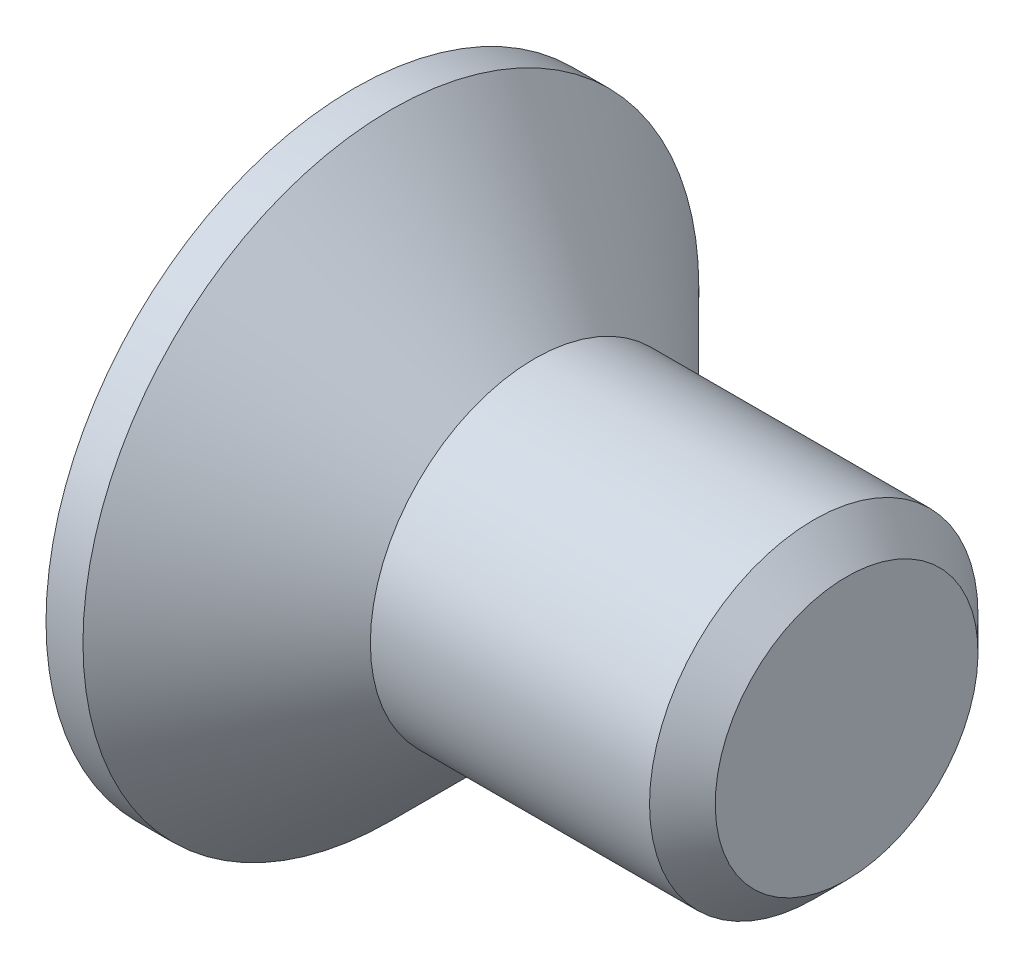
ISO-10303-21;
HEADER;
FILE_DESCRIPTION(('STEP AP214'),'2;1');
FILE_NAME('part.step','',(''),(''),'','','');
FILE_SCHEMA(('AUTOMOTIVE_DESIGN { 1 0 10303 214 1 1 1 1 }'));
ENDSEC;
DATA;
#1=APPLICATION_CONTEXT('core data for automotive mechanical design processes');
#2=APPLICATION_PROTOCOL_DEFINITION('international standard','automotive_design',2000,#1);
#3=PRODUCT_CONTEXT('',#1,'mechanical');
#4=PRODUCT('Part','Part','',(#3));
#5=PRODUCT_RELATED_PRODUCT_CATEGORY('part','',(#4));
#6=PRODUCT_DEFINITION_FORMATION('','',#4);
#7=PRODUCT_DEFINITION_CONTEXT('part definition',#1,'design');
#8=PRODUCT_DEFINITION('design','',#6,#7);
#9=PRODUCT_DEFINITION_SHAPE('','',#8);
#10=(LENGTH_UNIT() NAMED_UNIT(*) SI_UNIT(.MILLI.,.METRE.));
#11=(NAMED_UNIT(*) PLANE_ANGLE_UNIT() SI_UNIT($,.RADIAN.));
#12=(NAMED_UNIT(*) SI_UNIT($,.STERADIAN.) SOLID_ANGLE_UNIT());
#13=UNCERTAINTY_MEASURE_WITH_UNIT(LENGTH_MEASURE(1.E-05),#10,'distance_accuracy_value','');
#14=(GEOMETRIC_REPRESENTATION_CONTEXT(3) GLOBAL_UNCERTAINTY_ASSIGNED_CONTEXT((#13)) GLOBAL_UNIT_ASSIGNED_CONTEXT((#10,
#11,#12)) REPRESENTATION_CONTEXT('',''));
#15=CARTESIAN_POINT('',(0.,0.,0.));
#16=DIRECTION('',(0.,0.,1.));
#17=DIRECTION('',(1.,0.,0.));
#18=AXIS2_PLACEMENT_3D('',#15,#16,#17);
#19=CARTESIAN_POINT('',(0.,0.,0.));
#20=DIRECTION('',(-1.,0.,0.));
#21=DIRECTION('',(0.,-1.,0.));
#22=AXIS2_PLACEMENT_3D('',#19,#20,#21);
#23=CONICAL_SURFACE('',#22,2.,0.78539816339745);
#24=CARTESIAN_POINT('',(-1.74999999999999,0.,0.));
#25=DIRECTION('',(-1.,0.,0.));
#26=DIRECTION('',(0.,-1.,0.));
#27=AXIS2_PLACEMENT_3D('',#24,#25,#26);
#28=CIRCLE('',#27,3.75);
#29=CARTESIAN_POINT('',(-1.74999999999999,-3.75,0.));
#30=VERTEX_POINT('',#29);
#31=EDGE_CURVE('E189',#30,#30,#28,.T.);
#32=ORIENTED_EDGE('',*,*,#31,.F.);
#33=EDGE_LOOP('',(#32));
#34=FACE_BOUND('',#33,.T.);
#35=CARTESIAN_POINT('',(0.,0.,0.));
#36=DIRECTION('',(-1.,0.,0.));
#37=DIRECTION('',(0.,-1.,0.));
#38=AXIS2_PLACEMENT_3D('',#35,#36,#37);
#39=CIRCLE('',#38,2.);
#40=CARTESIAN_POINT('',(0.,-2.,0.));
#41=VERTEX_POINT('',#40);
#42=EDGE_CURVE('E212',#41,#41,#39,.T.);
#43=ORIENTED_EDGE('',*,*,#42,.T.);
#44=EDGE_LOOP('',(#43));
#45=FACE_BOUND('',#44,.T.);
#46=ADVANCED_FACE('F33',(#34,#45),#23,.T.);
#47=CARTESIAN_POINT('',(-2.2,0.,0.));
#48=DIRECTION('',(-1.,0.,0.));
#49=DIRECTION('',(0.,-1.,0.));
#50=AXIS2_PLACEMENT_3D('',#47,#48,#49);
#51=CYLINDRICAL_SURFACE('',#50,2.);
#52=CARTESIAN_POINT('',(3.4,0.,0.));
#53=DIRECTION('',(-1.,0.,0.));
#54=DIRECTION('',(0.,-1.,0.));
#55=AXIS2_PLACEMENT_3D('',#52,#53,#54);
#56=CIRCLE('',#55,2.);
#57=CARTESIAN_POINT('',(3.4,-2.,0.));
#58=VERTEX_POINT('',#57);
#59=EDGE_CURVE('E41',#58,#58,#56,.T.);
#60=ORIENTED_EDGE('',*,*,#59,.T.);
#61=EDGE_LOOP('',(#60));
#62=FACE_BOUND('',#61,.T.);
#63=ORIENTED_EDGE('',*,*,#42,.F.);
#64=EDGE_LOOP('',(#63));
#65=FACE_BOUND('',#64,.T.);
#66=ADVANCED_FACE('F217',(#62,#65),#51,.T.);
#67=CARTESIAN_POINT('',(3.8,0.,0.));
#68=DIRECTION('',(-1.,0.,0.));
#69=DIRECTION('',(0.,-1.,0.));
#70=AXIS2_PLACEMENT_3D('',#67,#68,#69);
#71=PLANE('',#70);
#72=CARTESIAN_POINT('',(3.8,0.,0.));
#73=DIRECTION('',(-1.,0.,0.));
#74=DIRECTION('',(0.,-1.,0.));
#75=AXIS2_PLACEMENT_3D('',#72,#73,#74);
#76=CIRCLE('',#75,1.6);
#77=CARTESIAN_POINT('',(3.8,-1.6,0.));
#78=VERTEX_POINT('',#77);
#79=EDGE_CURVE('E11',#78,#78,#76,.F.);
#80=ORIENTED_EDGE('',*,*,#79,.T.);
#81=EDGE_LOOP('',(#80));
#82=FACE_BOUND('',#81,.T.);
#83=ADVANCED_FACE('F239',(#82),#71,.F.);
#84=CARTESIAN_POINT('',(-2.2,3.75,0.));
#85=DIRECTION('',(1.,0.,0.));
#86=DIRECTION('',(0.,1.,0.));
#87=AXIS2_PLACEMENT_3D('',#84,#85,#86);
#88=PLANE('',#87);
#89=DIRECTION('',(0.,0.,-1.));
#90=VECTOR('',#89,1.);
#91=CARTESIAN_POINT('',(-2.2,0.55,-2.2));
#92=LINE('',#91,#90);
#93=CARTESIAN_POINT('',(-2.2,0.55,-0.55));
#94=VERTEX_POINT('',#93);
#95=CARTESIAN_POINT('',(-2.2,0.55,-2.2));
#96=VERTEX_POINT('',#95);
#97=EDGE_CURVE('E158',#94,#96,#92,.T.);
#98=ORIENTED_EDGE('',*,*,#97,.F.);
#99=DIRECTION('',(0.,-1.,0.));
#100=VECTOR('',#99,1.);
#101=CARTESIAN_POINT('',(-2.2,0.55,-0.55));
#102=LINE('',#101,#100);
#103=CARTESIAN_POINT('',(-2.2,2.2,-0.55));
#104=VERTEX_POINT('',#103);
#105=EDGE_CURVE('E48',#104,#94,#102,.T.);
#106=ORIENTED_EDGE('',*,*,#105,.F.);
#107=DIRECTION('',(0.,0.,-1.));
#108=VECTOR('',#107,1.);
#109=CARTESIAN_POINT('',(-2.2,2.2,-0.55));
#110=LINE('',#109,#108);
#111=CARTESIAN_POINT('',(-2.2,2.2,0.55));
#112=VERTEX_POINT('',#111);
#113=EDGE_CURVE('E185',#112,#104,#110,.T.);
#114=ORIENTED_EDGE('',*,*,#113,.F.);
#115=DIRECTION('',(0.,1.,0.));
#116=VECTOR('',#115,1.);
#117=CARTESIAN_POINT('',(-2.2,2.2,0.55));
#118=LINE('',#117,#116);
#119=CARTESIAN_POINT('',(-2.2,0.55,0.55));
#120=VERTEX_POINT('',#119);
#121=EDGE_CURVE('E183',#120,#112,#118,.T.);
#122=ORIENTED_EDGE('',*,*,#121,.F.);
#123=DIRECTION('',(0.,0.,-1.));
#124=VECTOR('',#123,1.);
#125=CARTESIAN_POINT('',(-2.2,0.55,0.55));
#126=LINE('',#125,#124);
#127=CARTESIAN_POINT('',(-2.2,0.55,2.2));
#128=VERTEX_POINT('',#127);
#129=EDGE_CURVE('E132',#128,#120,#126,.T.);
#130=ORIENTED_EDGE('',*,*,#129,.F.);
#131=DIRECTION('',(0.,1.,0.));
#132=VECTOR('',#131,1.);
#133=CARTESIAN_POINT('',(-2.2,0.55,2.2));
#134=LINE('',#133,#132);
#135=CARTESIAN_POINT('',(-2.2,-0.55,2.2));
#136=VERTEX_POINT('',#135);
#137=EDGE_CURVE('E179',#136,#128,#134,.T.);
#138=ORIENTED_EDGE('',*,*,#137,.F.);
#139=DIRECTION('',(0.,0.,1.));
#140=VECTOR('',#139,1.);
#141=CARTESIAN_POINT('',(-2.2,-0.55,2.2));
#142=LINE('',#141,#140);
#143=CARTESIAN_POINT('',(-2.2,-0.55,0.55));
#144=VERTEX_POINT('',#143);
#145=EDGE_CURVE('E176',#144,#136,#142,.T.);
#146=ORIENTED_EDGE('',*,*,#145,.F.);
#147=DIRECTION('',(0.,1.,0.));
#148=VECTOR('',#147,1.);
#149=CARTESIAN_POINT('',(-2.2,-0.55,0.55));
#150=LINE('',#149,#148);
#151=CARTESIAN_POINT('',(-2.2,-2.2,0.55));
#152=VERTEX_POINT('',#151);
#153=EDGE_CURVE('E173',#152,#144,#150,.T.);
#154=ORIENTED_EDGE('',*,*,#153,.F.);
#155=DIRECTION('',(0.,0.,1.));
#156=VECTOR('',#155,1.);
#157=CARTESIAN_POINT('',(-2.2,-2.2,0.55));
#158=LINE('',#157,#156);
#159=CARTESIAN_POINT('',(-2.2,-2.2,-0.55));
#160=VERTEX_POINT('',#159);
#161=EDGE_CURVE('E170',#160,#152,#158,.T.);
#162=ORIENTED_EDGE('',*,*,#161,.F.);
#163=DIRECTION('',(0.,-1.,0.));
#164=VECTOR('',#163,1.);
#165=CARTESIAN_POINT('',(-2.2,-2.2,-0.55));
#166=LINE('',#165,#164);
#167=CARTESIAN_POINT('',(-2.2,-0.55,-0.55));
#168=VERTEX_POINT('',#167);
#169=EDGE_CURVE('E167',#168,#160,#166,.T.);
#170=ORIENTED_EDGE('',*,*,#169,.F.);
#171=DIRECTION('',(0.,0.,1.));
#172=VECTOR('',#171,1.);
#173=CARTESIAN_POINT('',(-2.2,-0.55,-0.55));
#174=LINE('',#173,#172);
#175=CARTESIAN_POINT('',(-2.2,-0.55,-2.2));
#176=VERTEX_POINT('',#175);
#177=EDGE_CURVE('E164',#176,#168,#174,.T.);
#178=ORIENTED_EDGE('',*,*,#177,.F.);
#179=DIRECTION('',(0.,-1.,0.));
#180=VECTOR('',#179,1.);
#181=CARTESIAN_POINT('',(-2.2,-0.55,-2.2));
#182=LINE('',#181,#180);
#183=EDGE_CURVE('E161',#96,#176,#182,.T.);
#184=ORIENTED_EDGE('',*,*,#183,.F.);
#185=EDGE_LOOP('',(#98,#106,#114,#122,#130,#138,#146,#154,#162,#170,#178,#184));
#186=FACE_BOUND('',#185,.T.);
#187=CARTESIAN_POINT('',(-2.2,0.,0.));
#188=DIRECTION('',(-1.,0.,0.));
#189=DIRECTION('',(0.,-1.,0.));
#190=AXIS2_PLACEMENT_3D('',#187,#188,#189);
#191=CIRCLE('',#190,3.75);
#192=CARTESIAN_POINT('',(-2.2,-3.75,0.));
#193=VERTEX_POINT('',#192);
#194=EDGE_CURVE('E209',#193,#193,#191,.T.);
#195=ORIENTED_EDGE('',*,*,#194,.T.);
#196=EDGE_LOOP('',(#195));
#197=FACE_BOUND('',#196,.T.);
#198=ADVANCED_FACE('F230',(#186,#197),#88,.F.);
#199=CARTESIAN_POINT('',(-2.2,0.,0.));
#200=DIRECTION('',(-1.,0.,0.));
#201=DIRECTION('',(0.,-1.,0.));
#202=AXIS2_PLACEMENT_3D('',#199,#200,#201);
#203=CYLINDRICAL_SURFACE('',#202,3.75);
#204=ORIENTED_EDGE('',*,*,#194,.F.);
#205=EDGE_LOOP('',(#204));
#206=FACE_BOUND('',#205,.T.);
#207=ORIENTED_EDGE('',*,*,#31,.T.);
#208=EDGE_LOOP('',(#207));
#209=FACE_BOUND('',#208,.T.);
#210=ADVANCED_FACE('F222',(#206,#209),#203,.T.);
#211=CARTESIAN_POINT('',(3.4,0.,0.));
#212=DIRECTION('',(-1.,0.,0.));
#213=DIRECTION('',(0.,-1.,0.));
#214=AXIS2_PLACEMENT_3D('',#211,#212,#213);
#215=CONICAL_SURFACE('',#214,2.,0.78539816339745);
#216=ORIENTED_EDGE('',*,*,#79,.F.);
#217=EDGE_LOOP('',(#216));
#218=FACE_BOUND('',#217,.T.);
#219=ORIENTED_EDGE('',*,*,#59,.F.);
#220=EDGE_LOOP('',(#219));
#221=FACE_BOUND('',#220,.T.);
#222=ADVANCED_FACE('F35',(#218,#221),#215,.T.);
#223=CARTESIAN_POINT('',(-0.3,0.55,-0.55));
#224=DIRECTION('',(0.,0.,-1.));
#225=DIRECTION('',(-1.,0.,0.));
#226=AXIS2_PLACEMENT_3D('',#223,#224,#225);
#227=PLANE('',#226);
#228=ORIENTED_EDGE('',*,*,#105,.T.);
#229=DIRECTION('',(-1.,0.,0.));
#230=VECTOR('',#229,1.);
#231=CARTESIAN_POINT('',(-0.3,0.55,-0.55));
#232=LINE('',#231,#230);
#233=CARTESIAN_POINT('',(-0.3,0.55,-0.55));
#234=VERTEX_POINT('',#233);
#235=EDGE_CURVE('E96',#234,#94,#232,.T.);
#236=ORIENTED_EDGE('',*,*,#235,.F.);
#237=DIRECTION('',(0.,-1.,0.));
#238=VECTOR('',#237,1.);
#239=CARTESIAN_POINT('',(-0.3,0.55,-0.55));
#240=LINE('',#239,#238);
#241=CARTESIAN_POINT('',(-0.3,2.2,-0.55));
#242=VERTEX_POINT('',#241);
#243=EDGE_CURVE('E187',#242,#234,#240,.T.);
#244=ORIENTED_EDGE('',*,*,#243,.F.);
#245=DIRECTION('',(-1.,0.,0.));
#246=VECTOR('',#245,1.);
#247=CARTESIAN_POINT('',(-0.3,2.2,-0.55));
#248=LINE('',#247,#246);
#249=EDGE_CURVE('E56',#242,#104,#248,.T.);
#250=ORIENTED_EDGE('',*,*,#249,.T.);
#251=EDGE_LOOP('',(#228,#236,#244,#250));
#252=FACE_BOUND('',#251,.T.);
#253=ADVANCED_FACE('F221',(#252),#227,.F.);
#254=CARTESIAN_POINT('',(-0.3,2.2,-0.55));
#255=DIRECTION('',(0.,1.,0.));
#256=DIRECTION('',(-1.,0.,0.));
#257=AXIS2_PLACEMENT_3D('',#254,#255,#256);
#258=PLANE('',#257);
#259=ORIENTED_EDGE('',*,*,#113,.T.);
#260=ORIENTED_EDGE('',*,*,#249,.F.);
#261=DIRECTION('',(0.,0.,-1.));
#262=VECTOR('',#261,1.);
#263=CARTESIAN_POINT('',(-0.3,2.2,-0.55));
#264=LINE('',#263,#262);
#265=CARTESIAN_POINT('',(-0.3,2.2,0.55));
#266=VERTEX_POINT('',#265);
#267=EDGE_CURVE('E144',#266,#242,#264,.T.);
#268=ORIENTED_EDGE('',*,*,#267,.F.);
#269=DIRECTION('',(-1.,0.,0.));
#270=VECTOR('',#269,1.);
#271=CARTESIAN_POINT('',(-0.3,2.2,0.55));
#272=LINE('',#271,#270);
#273=EDGE_CURVE('E136',#266,#112,#272,.T.);
#274=ORIENTED_EDGE('',*,*,#273,.T.);
#275=EDGE_LOOP('',(#259,#260,#268,#274));
#276=FACE_BOUND('',#275,.T.);
#277=ADVANCED_FACE('F228',(#276),#258,.F.);
#278=CARTESIAN_POINT('',(-0.3,2.2,0.55));
#279=DIRECTION('',(0.,0.,1.));
#280=DIRECTION('',(1.,0.,0.));
#281=AXIS2_PLACEMENT_3D('',#278,#279,#280);
#282=PLANE('',#281);
#283=ORIENTED_EDGE('',*,*,#121,.T.);
#284=ORIENTED_EDGE('',*,*,#273,.F.);
#285=DIRECTION('',(0.,1.,0.));
#286=VECTOR('',#285,1.);
#287=CARTESIAN_POINT('',(-0.3,2.2,0.55));
#288=LINE('',#287,#286);
#289=CARTESIAN_POINT('',(-0.3,0.55,0.55));
#290=VERTEX_POINT('',#289);
#291=EDGE_CURVE('E140',#290,#266,#288,.T.);
#292=ORIENTED_EDGE('',*,*,#291,.F.);
#293=DIRECTION('',(-1.,0.,0.));
#294=VECTOR('',#293,1.);
#295=CARTESIAN_POINT('',(-0.3,0.55,0.55));
#296=LINE('',#295,#294);
#297=EDGE_CURVE('E125',#290,#120,#296,.T.);
#298=ORIENTED_EDGE('',*,*,#297,.T.);
#299=EDGE_LOOP('',(#283,#284,#292,#298));
#300=FACE_BOUND('',#299,.T.);
#301=ADVANCED_FACE('F141',(#300),#282,.F.);
#302=CARTESIAN_POINT('',(-0.3,0.55,0.55));
#303=DIRECTION('',(0.,1.,0.));
#304=DIRECTION('',(-1.,0.,0.));
#305=AXIS2_PLACEMENT_3D('',#302,#303,#304);
#306=PLANE('',#305);
#307=ORIENTED_EDGE('',*,*,#129,.T.);
#308=ORIENTED_EDGE('',*,*,#297,.F.);
#309=DIRECTION('',(0.,0.,-1.));
#310=VECTOR('',#309,1.);
#311=CARTESIAN_POINT('',(-0.3,0.55,0.55));
#312=LINE('',#311,#310);
#313=CARTESIAN_POINT('',(-0.3,0.55,2.2));
#314=VERTEX_POINT('',#313);
#315=EDGE_CURVE('E129',#314,#290,#312,.T.);
#316=ORIENTED_EDGE('',*,*,#315,.F.);
#317=DIRECTION('',(-1.,0.,0.));
#318=VECTOR('',#317,1.);
#319=CARTESIAN_POINT('',(-0.3,0.55,2.2));
#320=LINE('',#319,#318);
#321=EDGE_CURVE('E137',#314,#128,#320,.T.);
#322=ORIENTED_EDGE('',*,*,#321,.T.);
#323=EDGE_LOOP('',(#307,#308,#316,#322));
#324=FACE_BOUND('',#323,.T.);
#325=ADVANCED_FACE('F127',(#324),#306,.F.);
#326=CARTESIAN_POINT('',(-0.3,0.55,2.2));
#327=DIRECTION('',(0.,0.,1.));
#328=DIRECTION('',(1.,0.,0.));
#329=AXIS2_PLACEMENT_3D('',#326,#327,#328);
#330=PLANE('',#329);
#331=ORIENTED_EDGE('',*,*,#137,.T.);
#332=ORIENTED_EDGE('',*,*,#321,.F.);
#333=DIRECTION('',(0.,1.,0.));
#334=VECTOR('',#333,1.);
#335=CARTESIAN_POINT('',(-0.3,0.55,2.2));
#336=LINE('',#335,#334);
#337=CARTESIAN_POINT('',(-0.3,-0.55,2.2));
#338=VERTEX_POINT('',#337);
#339=EDGE_CURVE('E150',#338,#314,#336,.T.);
#340=ORIENTED_EDGE('',*,*,#339,.F.);
#341=DIRECTION('',(-1.,0.,0.));
#342=VECTOR('',#341,1.);
#343=CARTESIAN_POINT('',(-0.3,-0.55,2.2));
#344=LINE('',#343,#342);
#345=EDGE_CURVE('E192',#338,#136,#344,.T.);
#346=ORIENTED_EDGE('',*,*,#345,.T.);
#347=EDGE_LOOP('',(#331,#332,#340,#346));
#348=FACE_BOUND('',#347,.T.);
#349=ADVANCED_FACE('F277',(#348),#330,.F.);
#350=CARTESIAN_POINT('',(-0.3,-0.55,2.2));
#351=DIRECTION('',(0.,-1.,0.));
#352=DIRECTION('',(1.,0.,0.));
#353=AXIS2_PLACEMENT_3D('',#350,#351,#352);
#354=PLANE('',#353);
#355=ORIENTED_EDGE('',*,*,#145,.T.);
#356=ORIENTED_EDGE('',*,*,#345,.F.);
#357=DIRECTION('',(0.,0.,1.));
#358=VECTOR('',#357,1.);
#359=CARTESIAN_POINT('',(-0.3,-0.55,2.2));
#360=LINE('',#359,#358);
#361=CARTESIAN_POINT('',(-0.3,-0.55,0.55));
#362=VERTEX_POINT('',#361);
#363=EDGE_CURVE('E152',#362,#338,#360,.T.);
#364=ORIENTED_EDGE('',*,*,#363,.F.);
#365=DIRECTION('',(-1.,0.,0.));
#366=VECTOR('',#365,1.);
#367=CARTESIAN_POINT('',(-0.3,-0.55,0.55));
#368=LINE('',#367,#366);
#369=EDGE_CURVE('E194',#362,#144,#368,.T.);
#370=ORIENTED_EDGE('',*,*,#369,.T.);
#371=EDGE_LOOP('',(#355,#356,#364,#370));
#372=FACE_BOUND('',#371,.T.);
#373=ADVANCED_FACE('F273',(#372),#354,.F.);
#374=CARTESIAN_POINT('',(-0.3,-0.55,0.55));
#375=DIRECTION('',(0.,0.,1.));
#376=DIRECTION('',(1.,0.,0.));
#377=AXIS2_PLACEMENT_3D('',#374,#375,#376);
#378=PLANE('',#377);
#379=ORIENTED_EDGE('',*,*,#153,.T.);
#380=ORIENTED_EDGE('',*,*,#369,.F.);
#381=DIRECTION('',(0.,1.,0.));
#382=VECTOR('',#381,1.);
#383=CARTESIAN_POINT('',(-0.3,-0.55,0.55));
#384=LINE('',#383,#382);
#385=CARTESIAN_POINT('',(-0.3,-2.2,0.55));
#386=VERTEX_POINT('',#385);
#387=EDGE_CURVE('E422',#386,#362,#384,.T.);
#388=ORIENTED_EDGE('',*,*,#387,.F.);
#389=DIRECTION('',(-1.,0.,0.));
#390=VECTOR('',#389,1.);
#391=CARTESIAN_POINT('',(-0.3,-2.2,0.55));
#392=LINE('',#391,#390);
#393=EDGE_CURVE('E196',#386,#152,#392,.T.);
#394=ORIENTED_EDGE('',*,*,#393,.T.);
#395=EDGE_LOOP('',(#379,#380,#388,#394));
#396=FACE_BOUND('',#395,.T.);
#397=ADVANCED_FACE('F269',(#396),#378,.F.);
#398=CARTESIAN_POINT('',(-0.3,-2.2,0.55));
#399=DIRECTION('',(0.,-1.,0.));
#400=DIRECTION('',(1.,0.,0.));
#401=AXIS2_PLACEMENT_3D('',#398,#399,#400);
#402=PLANE('',#401);
#403=ORIENTED_EDGE('',*,*,#161,.T.);
#404=ORIENTED_EDGE('',*,*,#393,.F.);
#405=DIRECTION('',(0.,0.,1.));
#406=VECTOR('',#405,1.);
#407=CARTESIAN_POINT('',(-0.3,-2.2,0.55));
#408=LINE('',#407,#406);
#409=CARTESIAN_POINT('',(-0.3,-2.2,-0.55));
#410=VERTEX_POINT('',#409);
#411=EDGE_CURVE('E419',#410,#386,#408,.T.);
#412=ORIENTED_EDGE('',*,*,#411,.F.);
#413=DIRECTION('',(-1.,0.,0.));
#414=VECTOR('',#413,1.);
#415=CARTESIAN_POINT('',(-0.3,-2.2,-0.55));
#416=LINE('',#415,#414);
#417=EDGE_CURVE('E198',#410,#160,#416,.T.);
#418=ORIENTED_EDGE('',*,*,#417,.T.);
#419=EDGE_LOOP('',(#403,#404,#412,#418));
#420=FACE_BOUND('',#419,.T.);
#421=ADVANCED_FACE('F265',(#420),#402,.F.);
#422=CARTESIAN_POINT('',(-0.3,-2.2,-0.55));
#423=DIRECTION('',(0.,0.,-1.));
#424=DIRECTION('',(-1.,0.,0.));
#425=AXIS2_PLACEMENT_3D('',#422,#423,#424);
#426=PLANE('',#425);
#427=ORIENTED_EDGE('',*,*,#169,.T.);
#428=ORIENTED_EDGE('',*,*,#417,.F.);
#429=DIRECTION('',(0.,-1.,0.));
#430=VECTOR('',#429,1.);
#431=CARTESIAN_POINT('',(-0.3,-2.2,-0.55));
#432=LINE('',#431,#430);
#433=CARTESIAN_POINT('',(-0.3,-0.55,-0.55));
#434=VERTEX_POINT('',#433);
#435=EDGE_CURVE('E416',#434,#410,#432,.T.);
#436=ORIENTED_EDGE('',*,*,#435,.F.);
#437=DIRECTION('',(-1.,0.,0.));
#438=VECTOR('',#437,1.);
#439=CARTESIAN_POINT('',(-0.3,-0.55,-0.55));
#440=LINE('',#439,#438);
#441=EDGE_CURVE('E200',#434,#168,#440,.T.);
#442=ORIENTED_EDGE('',*,*,#441,.T.);
#443=EDGE_LOOP('',(#427,#428,#436,#442));
#444=FACE_BOUND('',#443,.T.);
#445=ADVANCED_FACE('F261',(#444),#426,.F.);
#446=CARTESIAN_POINT('',(-0.3,-0.55,-0.55));
#447=DIRECTION('',(0.,-1.,0.));
#448=DIRECTION('',(1.,0.,0.));
#449=AXIS2_PLACEMENT_3D('',#446,#447,#448);
#450=PLANE('',#449);
#451=ORIENTED_EDGE('',*,*,#177,.T.);
#452=ORIENTED_EDGE('',*,*,#441,.F.);
#453=DIRECTION('',(0.,0.,1.));
#454=VECTOR('',#453,1.);
#455=CARTESIAN_POINT('',(-0.3,-0.55,-0.55));
#456=LINE('',#455,#454);
#457=CARTESIAN_POINT('',(-0.3,-0.55,-2.2));
#458=VERTEX_POINT('',#457);
#459=EDGE_CURVE('E413',#458,#434,#456,.T.);
#460=ORIENTED_EDGE('',*,*,#459,.F.);
#461=DIRECTION('',(-1.,0.,0.));
#462=VECTOR('',#461,1.);
#463=CARTESIAN_POINT('',(-0.3,-0.55,-2.2));
#464=LINE('',#463,#462);
#465=EDGE_CURVE('E202',#458,#176,#464,.T.);
#466=ORIENTED_EDGE('',*,*,#465,.T.);
#467=EDGE_LOOP('',(#451,#452,#460,#466));
#468=FACE_BOUND('',#467,.T.);
#469=ADVANCED_FACE('F257',(#468),#450,.F.);
#470=CARTESIAN_POINT('',(-0.3,-0.55,-2.2));
#471=DIRECTION('',(0.,0.,-1.));
#472=DIRECTION('',(-1.,0.,0.));
#473=AXIS2_PLACEMENT_3D('',#470,#471,#472);
#474=PLANE('',#473);
#475=ORIENTED_EDGE('',*,*,#183,.T.);
#476=ORIENTED_EDGE('',*,*,#465,.F.);
#477=DIRECTION('',(0.,-1.,0.));
#478=VECTOR('',#477,1.);
#479=CARTESIAN_POINT('',(-0.3,-0.55,-2.2));
#480=LINE('',#479,#478);
#481=CARTESIAN_POINT('',(-0.3,0.55,-2.2));
#482=VERTEX_POINT('',#481);
#483=EDGE_CURVE('E408',#482,#458,#480,.T.);
#484=ORIENTED_EDGE('',*,*,#483,.F.);
#485=DIRECTION('',(-1.,0.,0.));
#486=VECTOR('',#485,1.);
#487=CARTESIAN_POINT('',(-0.3,0.55,-2.2));
#488=LINE('',#487,#486);
#489=EDGE_CURVE('E204',#482,#96,#488,.T.);
#490=ORIENTED_EDGE('',*,*,#489,.T.);
#491=EDGE_LOOP('',(#475,#476,#484,#490));
#492=FACE_BOUND('',#491,.T.);
#493=ADVANCED_FACE('F253',(#492),#474,.F.);
#494=CARTESIAN_POINT('',(-0.3,0.55,-2.2));
#495=DIRECTION('',(0.,1.,0.));
#496=DIRECTION('',(-1.,0.,0.));
#497=AXIS2_PLACEMENT_3D('',#494,#495,#496);
#498=PLANE('',#497);
#499=ORIENTED_EDGE('',*,*,#97,.T.);
#500=ORIENTED_EDGE('',*,*,#489,.F.);
#501=DIRECTION('',(0.,0.,-1.));
#502=VECTOR('',#501,1.);
#503=CARTESIAN_POINT('',(-0.3,0.55,-2.2));
#504=LINE('',#503,#502);
#505=EDGE_CURVE('E406',#234,#482,#504,.T.);
#506=ORIENTED_EDGE('',*,*,#505,.F.);
#507=ORIENTED_EDGE('',*,*,#235,.T.);
#508=EDGE_LOOP('',(#499,#500,#506,#507));
#509=FACE_BOUND('',#508,.T.);
#510=ADVANCED_FACE('F250',(#509),#498,.F.);
#511=CARTESIAN_POINT('',(-0.3,0.,0.));
#512=DIRECTION('',(1.,0.,0.));
#513=DIRECTION('',(0.,0.,-1.));
#514=AXIS2_PLACEMENT_3D('',#511,#512,#513);
#515=PLANE('',#514);
#516=ORIENTED_EDGE('',*,*,#243,.T.);
#517=ORIENTED_EDGE('',*,*,#505,.T.);
#518=ORIENTED_EDGE('',*,*,#483,.T.);
#519=ORIENTED_EDGE('',*,*,#459,.T.);
#520=ORIENTED_EDGE('',*,*,#435,.T.);
#521=ORIENTED_EDGE('',*,*,#411,.T.);
#522=ORIENTED_EDGE('',*,*,#387,.T.);
#523=ORIENTED_EDGE('',*,*,#363,.T.);
#524=ORIENTED_EDGE('',*,*,#339,.T.);
#525=ORIENTED_EDGE('',*,*,#315,.T.);
#526=ORIENTED_EDGE('',*,*,#291,.T.);
#527=ORIENTED_EDGE('',*,*,#267,.T.);
#528=EDGE_LOOP('',(#516,#517,#518,#519,#520,#521,#522,#523,#524,#525,#526,#527));
#529=FACE_BOUND('',#528,.T.);
#530=ADVANCED_FACE('F147',(#529),#515,.F.);
#531=CLOSED_SHELL('',(#46,#66,#83,#198,#210,#222,#253,#277,#301,#325,#349,#373,#397,#421,#445,
#469,#493,#510,#530));
#532=MANIFOLD_SOLID_BREP('B2',#531);
#533=ADVANCED_BREP_SHAPE_REPRESENTATION('',(#18,#532),#14);
#534=SHAPE_DEFINITION_REPRESENTATION(#9,#533);
ENDSEC;
END-ISO-10303-21;
